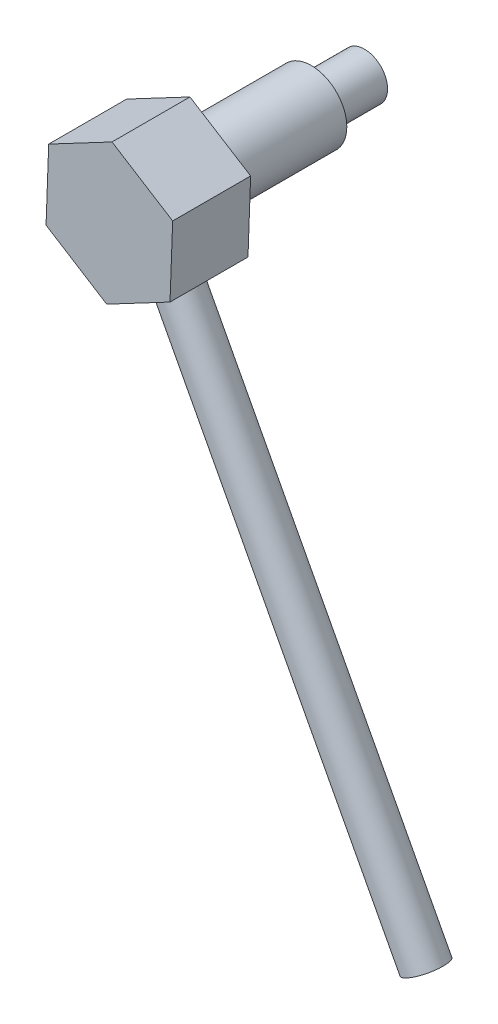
ISO-10303-21;
HEADER;
FILE_DESCRIPTION(('STEP AP214'),'2;1');
FILE_NAME('part.step','',(''),(''),'','','');
FILE_SCHEMA(('AUTOMOTIVE_DESIGN { 1 0 10303 214 1 1 1 1 }'));
ENDSEC;
DATA;
#1=APPLICATION_CONTEXT('core data for automotive mechanical design processes');
#2=APPLICATION_PROTOCOL_DEFINITION('international standard','automotive_design',2000,#1);
#3=PRODUCT_CONTEXT('',#1,'mechanical');
#4=PRODUCT('Part','Part','',(#3));
#5=PRODUCT_RELATED_PRODUCT_CATEGORY('part','',(#4));
#6=PRODUCT_DEFINITION_FORMATION('','',#4);
#7=PRODUCT_DEFINITION_CONTEXT('part definition',#1,'design');
#8=PRODUCT_DEFINITION('design','',#6,#7);
#9=PRODUCT_DEFINITION_SHAPE('','',#8);
#10=(LENGTH_UNIT() NAMED_UNIT(*) SI_UNIT(.MILLI.,.METRE.));
#11=(NAMED_UNIT(*) PLANE_ANGLE_UNIT() SI_UNIT($,.RADIAN.));
#12=(NAMED_UNIT(*) SI_UNIT($,.STERADIAN.) SOLID_ANGLE_UNIT());
#13=UNCERTAINTY_MEASURE_WITH_UNIT(LENGTH_MEASURE(1.E-05),#10,'distance_accuracy_value','');
#14=(GEOMETRIC_REPRESENTATION_CONTEXT(3) GLOBAL_UNCERTAINTY_ASSIGNED_CONTEXT((#13)) GLOBAL_UNIT_ASSIGNED_CONTEXT((#10,
#11,#12)) REPRESENTATION_CONTEXT('',''));
#15=CARTESIAN_POINT('',(0.,0.,0.));
#16=DIRECTION('',(0.,0.,1.));
#17=DIRECTION('',(1.,0.,0.));
#18=AXIS2_PLACEMENT_3D('',#15,#16,#17);
#19=CARTESIAN_POINT('',(-0.149575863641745,-4.03868300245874,4.4));
#20=DIRECTION('',(-0.467605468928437,0.883937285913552,0.));
#21=DIRECTION('',(-0.883937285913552,-0.467605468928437,0.));
#22=AXIS2_PLACEMENT_3D('',#19,#20,#21);
#23=PLANE('',#22);
#24=DIRECTION('',(0.883937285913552,0.467605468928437,0.));
#25=VECTOR('',#24,1.);
#26=CARTESIAN_POINT('',(-0.149575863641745,-4.03868300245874,0.));
#27=LINE('',#26,#25);
#28=CARTESIAN_POINT('',(-0.149575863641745,-4.03868300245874,0.));
#29=VERTEX_POINT('',#28);
#30=CARTESIAN_POINT('',(3.42281414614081,-2.14887799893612,0.));
#31=VERTEX_POINT('',#30);
#32=EDGE_CURVE('E56',#29,#31,#27,.T.);
#33=ORIENTED_EDGE('',*,*,#32,.T.);
#34=DIRECTION('',(0.,0.,-1.));
#35=VECTOR('',#34,1.);
#36=CARTESIAN_POINT('',(3.42281414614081,-2.14887799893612,4.4));
#37=LINE('',#36,#35);
#38=CARTESIAN_POINT('',(3.42281414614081,-2.14887799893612,4.4));
#39=VERTEX_POINT('',#38);
#40=EDGE_CURVE('E94',#39,#31,#37,.T.);
#41=ORIENTED_EDGE('',*,*,#40,.F.);
#42=DIRECTION('',(0.883937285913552,0.467605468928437,0.));
#43=VECTOR('',#42,1.);
#44=CARTESIAN_POINT('',(-0.149575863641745,-4.03868300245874,4.4));
#45=LINE('',#44,#43);
#46=CARTESIAN_POINT('',(-0.149575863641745,-4.03868300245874,4.4));
#47=VERTEX_POINT('',#46);
#48=EDGE_CURVE('E82',#47,#39,#45,.T.);
#49=ORIENTED_EDGE('',*,*,#48,.F.);
#50=DIRECTION('',(0.,0.,-1.));
#51=VECTOR('',#50,1.);
#52=CARTESIAN_POINT('',(-0.149575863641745,-4.03868300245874,4.4));
#53=LINE('',#52,#51);
#54=EDGE_CURVE('E89',#47,#29,#53,.T.);
#55=ORIENTED_EDGE('',*,*,#54,.T.);
#56=EDGE_LOOP('',(#33,#41,#49,#55));
#57=FACE_BOUND('',#56,.T.);
#58=CARTESIAN_POINT('',(1.63661914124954,-3.09378050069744,2.2));
#59=DIRECTION('',(-0.467605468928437,0.883937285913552,0.));
#60=DIRECTION('',(-0.883937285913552,-0.467605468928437,0.));
#61=AXIS2_PLACEMENT_3D('',#58,#59,#60);
#62=CIRCLE('',#61,1.1);
#63=CARTESIAN_POINT('',(0.664288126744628,-3.60814651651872,2.2));
#64=VERTEX_POINT('',#63);
#65=EDGE_CURVE('E11',#64,#64,#62,.F.);
#66=ORIENTED_EDGE('',*,*,#65,.F.);
#67=EDGE_LOOP('',(#66));
#68=FACE_BOUND('',#67,.T.);
#69=ADVANCED_FACE('F16',(#57,#68),#23,.F.);
#70=CARTESIAN_POINT('',(0.,0.,-7.));
#71=DIRECTION('',(0.,0.,-1.));
#72=DIRECTION('',(-1.,0.,0.));
#73=AXIS2_PLACEMENT_3D('',#70,#71,#72);
#74=PLANE('',#73);
#75=CARTESIAN_POINT('',(0.,0.,-7.));
#76=DIRECTION('',(0.,0.,-1.));
#77=DIRECTION('',(-1.,0.,0.));
#78=AXIS2_PLACEMENT_3D('',#75,#76,#77);
#79=CIRCLE('',#78,2.);
#80=CARTESIAN_POINT('',(-2.,0.,-7.));
#81=VERTEX_POINT('',#80);
#82=EDGE_CURVE('E106',#81,#81,#79,.T.);
#83=ORIENTED_EDGE('',*,*,#82,.T.);
#84=EDGE_LOOP('',(#83));
#85=FACE_BOUND('',#84,.T.);
#86=CARTESIAN_POINT('',(0.,0.,-7.));
#87=DIRECTION('',(0.,0.,-1.));
#88=DIRECTION('',(-1.,0.,0.));
#89=AXIS2_PLACEMENT_3D('',#86,#87,#88);
#90=CIRCLE('',#89,1.3);
#91=CARTESIAN_POINT('',(-1.3,0.,-7.));
#92=VERTEX_POINT('',#91);
#93=EDGE_CURVE('E197',#92,#92,#90,.T.);
#94=ORIENTED_EDGE('',*,*,#93,.F.);
#95=EDGE_LOOP('',(#94));
#96=FACE_BOUND('',#95,.T.);
#97=ADVANCED_FACE('F128',(#85,#96),#74,.T.);
#98=CARTESIAN_POINT('',(0.,0.,0.));
#99=DIRECTION('',(0.,0.,1.));
#100=DIRECTION('',(1.,0.,0.));
#101=AXIS2_PLACEMENT_3D('',#98,#99,#100);
#102=PLANE('',#101);
#103=DIRECTION('',(-0.846926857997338,0.531709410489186,0.));
#104=VECTOR('',#103,1.);
#105=CARTESIAN_POINT('',(3.57239000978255,1.88980500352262,0.));
#106=LINE('',#105,#104);
#107=CARTESIAN_POINT('',(3.57239000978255,1.88980500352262,0.));
#108=VERTEX_POINT('',#107);
#109=CARTESIAN_POINT('',(0.149575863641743,4.03868300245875,0.));
#110=VERTEX_POINT('',#109);
#111=EDGE_CURVE('E102',#108,#110,#106,.T.);
#112=ORIENTED_EDGE('',*,*,#111,.F.);
#113=DIRECTION('',(0.037010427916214,0.999314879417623,0.));
#114=VECTOR('',#113,1.);
#115=CARTESIAN_POINT('',(3.42281414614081,-2.14887799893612,0.));
#116=LINE('',#115,#114);
#117=EDGE_CURVE('E62',#31,#108,#116,.T.);
#118=ORIENTED_EDGE('',*,*,#117,.F.);
#119=ORIENTED_EDGE('',*,*,#32,.F.);
#120=DIRECTION('',(0.846926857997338,-0.531709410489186,0.));
#121=VECTOR('',#120,1.);
#122=CARTESIAN_POINT('',(-3.57239000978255,-1.88980500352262,0.));
#123=LINE('',#122,#121);
#124=CARTESIAN_POINT('',(-3.57239000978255,-1.88980500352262,0.));
#125=VERTEX_POINT('',#124);
#126=EDGE_CURVE('E92',#125,#29,#123,.T.);
#127=ORIENTED_EDGE('',*,*,#126,.F.);
#128=DIRECTION('',(-0.0370104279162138,-0.999314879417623,0.));
#129=VECTOR('',#128,1.);
#130=CARTESIAN_POINT('',(-3.42281414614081,2.14887799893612,0.));
#131=LINE('',#130,#129);
#132=CARTESIAN_POINT('',(-3.42281414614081,2.14887799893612,0.));
#133=VERTEX_POINT('',#132);
#134=EDGE_CURVE('E108',#133,#125,#131,.T.);
#135=ORIENTED_EDGE('',*,*,#134,.F.);
#136=DIRECTION('',(-0.883937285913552,-0.467605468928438,0.));
#137=VECTOR('',#136,1.);
#138=CARTESIAN_POINT('',(0.149575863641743,4.03868300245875,0.));
#139=LINE('',#138,#137);
#140=EDGE_CURVE('E105',#110,#133,#139,.T.);
#141=ORIENTED_EDGE('',*,*,#140,.F.);
#142=EDGE_LOOP('',(#112,#118,#119,#127,#135,#141));
#143=FACE_BOUND('',#142,.T.);
#144=CARTESIAN_POINT('',(0.,0.,0.));
#145=DIRECTION('',(0.,0.,1.));
#146=DIRECTION('',(1.,0.,0.));
#147=AXIS2_PLACEMENT_3D('',#144,#145,#146);
#148=CIRCLE('',#147,2.);
#149=CARTESIAN_POINT('',(2.,0.,0.));
#150=VERTEX_POINT('',#149);
#151=EDGE_CURVE('E25',#150,#150,#148,.F.);
#152=ORIENTED_EDGE('',*,*,#151,.F.);
#153=EDGE_LOOP('',(#152));
#154=FACE_BOUND('',#153,.T.);
#155=ADVANCED_FACE('F126',(#143,#154),#102,.F.);
#156=CARTESIAN_POINT('',(3.57239000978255,1.88980500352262,4.4));
#157=DIRECTION('',(-0.531709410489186,-0.846926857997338,0.));
#158=DIRECTION('',(0.846926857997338,-0.531709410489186,0.));
#159=AXIS2_PLACEMENT_3D('',#156,#157,#158);
#160=PLANE('',#159);
#161=ORIENTED_EDGE('',*,*,#111,.T.);
#162=DIRECTION('',(0.,0.,-1.));
#163=VECTOR('',#162,1.);
#164=CARTESIAN_POINT('',(0.149575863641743,4.03868300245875,4.4));
#165=LINE('',#164,#163);
#166=CARTESIAN_POINT('',(0.149575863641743,4.03868300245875,4.4));
#167=VERTEX_POINT('',#166);
#168=EDGE_CURVE('E120',#167,#110,#165,.T.);
#169=ORIENTED_EDGE('',*,*,#168,.F.);
#170=DIRECTION('',(-0.846926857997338,0.531709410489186,0.));
#171=VECTOR('',#170,1.);
#172=CARTESIAN_POINT('',(3.57239000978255,1.88980500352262,4.4));
#173=LINE('',#172,#171);
#174=CARTESIAN_POINT('',(3.57239000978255,1.88980500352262,4.4));
#175=VERTEX_POINT('',#174);
#176=EDGE_CURVE('E113',#175,#167,#173,.T.);
#177=ORIENTED_EDGE('',*,*,#176,.F.);
#178=DIRECTION('',(0.,0.,-1.));
#179=VECTOR('',#178,1.);
#180=CARTESIAN_POINT('',(3.57239000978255,1.88980500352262,4.4));
#181=LINE('',#180,#179);
#182=EDGE_CURVE('E98',#175,#108,#181,.T.);
#183=ORIENTED_EDGE('',*,*,#182,.T.);
#184=EDGE_LOOP('',(#161,#169,#177,#183));
#185=FACE_BOUND('',#184,.T.);
#186=ADVANCED_FACE('F18',(#185),#160,.F.);
#187=CARTESIAN_POINT('',(0.149575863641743,4.03868300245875,4.4));
#188=DIRECTION('',(0.467605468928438,-0.883937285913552,0.));
#189=DIRECTION('',(0.883937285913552,0.467605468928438,0.));
#190=AXIS2_PLACEMENT_3D('',#187,#188,#189);
#191=PLANE('',#190);
#192=ORIENTED_EDGE('',*,*,#140,.T.);
#193=DIRECTION('',(0.,0.,-1.));
#194=VECTOR('',#193,1.);
#195=CARTESIAN_POINT('',(-3.42281414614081,2.14887799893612,4.4));
#196=LINE('',#195,#194);
#197=CARTESIAN_POINT('',(-3.42281414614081,2.14887799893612,4.4));
#198=VERTEX_POINT('',#197);
#199=EDGE_CURVE('E117',#198,#133,#196,.T.);
#200=ORIENTED_EDGE('',*,*,#199,.F.);
#201=DIRECTION('',(-0.883937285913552,-0.467605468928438,0.));
#202=VECTOR('',#201,1.);
#203=CARTESIAN_POINT('',(0.149575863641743,4.03868300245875,4.4));
#204=LINE('',#203,#202);
#205=EDGE_CURVE('E71',#167,#198,#204,.T.);
#206=ORIENTED_EDGE('',*,*,#205,.F.);
#207=ORIENTED_EDGE('',*,*,#168,.T.);
#208=EDGE_LOOP('',(#192,#200,#206,#207));
#209=FACE_BOUND('',#208,.T.);
#210=ADVANCED_FACE('F137',(#209),#191,.F.);
#211=CARTESIAN_POINT('',(-3.42281414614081,2.14887799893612,4.4));
#212=DIRECTION('',(0.999314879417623,-0.0370104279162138,0.));
#213=DIRECTION('',(0.0370104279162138,0.999314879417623,0.));
#214=AXIS2_PLACEMENT_3D('',#211,#212,#213);
#215=PLANE('',#214);
#216=ORIENTED_EDGE('',*,*,#134,.T.);
#217=DIRECTION('',(0.,0.,-1.));
#218=VECTOR('',#217,1.);
#219=CARTESIAN_POINT('',(-3.57239000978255,-1.88980500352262,4.4));
#220=LINE('',#219,#218);
#221=CARTESIAN_POINT('',(-3.57239000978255,-1.88980500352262,4.4));
#222=VERTEX_POINT('',#221);
#223=EDGE_CURVE('E93',#222,#125,#220,.T.);
#224=ORIENTED_EDGE('',*,*,#223,.F.);
#225=DIRECTION('',(-0.0370104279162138,-0.999314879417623,0.));
#226=VECTOR('',#225,1.);
#227=CARTESIAN_POINT('',(-3.42281414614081,2.14887799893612,4.4));
#228=LINE('',#227,#226);
#229=EDGE_CURVE('E84',#198,#222,#228,.T.);
#230=ORIENTED_EDGE('',*,*,#229,.F.);
#231=ORIENTED_EDGE('',*,*,#199,.T.);
#232=EDGE_LOOP('',(#216,#224,#230,#231));
#233=FACE_BOUND('',#232,.T.);
#234=ADVANCED_FACE('F153',(#233),#215,.F.);
#235=CARTESIAN_POINT('',(-3.57239000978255,-1.88980500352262,4.4));
#236=DIRECTION('',(0.531709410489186,0.846926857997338,0.));
#237=DIRECTION('',(-0.846926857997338,0.531709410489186,0.));
#238=AXIS2_PLACEMENT_3D('',#235,#236,#237);
#239=PLANE('',#238);
#240=ORIENTED_EDGE('',*,*,#126,.T.);
#241=ORIENTED_EDGE('',*,*,#54,.F.);
#242=DIRECTION('',(0.846926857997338,-0.531709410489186,0.));
#243=VECTOR('',#242,1.);
#244=CARTESIAN_POINT('',(-3.57239000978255,-1.88980500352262,4.4));
#245=LINE('',#244,#243);
#246=EDGE_CURVE('E78',#222,#47,#245,.T.);
#247=ORIENTED_EDGE('',*,*,#246,.F.);
#248=ORIENTED_EDGE('',*,*,#223,.T.);
#249=EDGE_LOOP('',(#240,#241,#247,#248));
#250=FACE_BOUND('',#249,.T.);
#251=ADVANCED_FACE('F90',(#250),#239,.F.);
#252=CARTESIAN_POINT('',(3.42281414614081,-2.14887799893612,4.4));
#253=DIRECTION('',(-0.999314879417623,0.037010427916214,0.));
#254=DIRECTION('',(-0.037010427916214,-0.999314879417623,0.));
#255=AXIS2_PLACEMENT_3D('',#252,#253,#254);
#256=PLANE('',#255);
#257=ORIENTED_EDGE('',*,*,#117,.T.);
#258=ORIENTED_EDGE('',*,*,#182,.F.);
#259=DIRECTION('',(0.037010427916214,0.999314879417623,0.));
#260=VECTOR('',#259,1.);
#261=CARTESIAN_POINT('',(3.42281414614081,-2.14887799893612,4.4));
#262=LINE('',#261,#260);
#263=EDGE_CURVE('E33',#39,#175,#262,.T.);
#264=ORIENTED_EDGE('',*,*,#263,.F.);
#265=ORIENTED_EDGE('',*,*,#40,.T.);
#266=EDGE_LOOP('',(#257,#258,#264,#265));
#267=FACE_BOUND('',#266,.T.);
#268=ADVANCED_FACE('F150',(#267),#256,.F.);
#269=CARTESIAN_POINT('',(0.,0.,4.4));
#270=DIRECTION('',(0.,0.,1.));
#271=DIRECTION('',(1.,0.,0.));
#272=AXIS2_PLACEMENT_3D('',#269,#270,#271);
#273=PLANE('',#272);
#274=ORIENTED_EDGE('',*,*,#176,.T.);
#275=ORIENTED_EDGE('',*,*,#205,.T.);
#276=ORIENTED_EDGE('',*,*,#229,.T.);
#277=ORIENTED_EDGE('',*,*,#246,.T.);
#278=ORIENTED_EDGE('',*,*,#48,.T.);
#279=ORIENTED_EDGE('',*,*,#263,.T.);
#280=EDGE_LOOP('',(#274,#275,#276,#277,#278,#279));
#281=FACE_BOUND('',#280,.T.);
#282=ADVANCED_FACE('F80',(#281),#273,.T.);
#283=CARTESIAN_POINT('',(0.,0.,-7.));
#284=DIRECTION('',(0.,0.,1.));
#285=DIRECTION('',(1.,0.,0.));
#286=AXIS2_PLACEMENT_3D('',#283,#284,#285);
#287=CYLINDRICAL_SURFACE('',#286,2.);
#288=ORIENTED_EDGE('',*,*,#82,.F.);
#289=EDGE_LOOP('',(#288));
#290=FACE_BOUND('',#289,.T.);
#291=ORIENTED_EDGE('',*,*,#151,.T.);
#292=EDGE_LOOP('',(#291));
#293=FACE_BOUND('',#292,.T.);
#294=ADVANCED_FACE('F124',(#290,#293),#287,.T.);
#295=CARTESIAN_POINT('',(0.,0.,-10.));
#296=DIRECTION('',(0.,0.,1.));
#297=DIRECTION('',(1.,0.,0.));
#298=AXIS2_PLACEMENT_3D('',#295,#296,#297);
#299=CYLINDRICAL_SURFACE('',#298,1.3);
#300=CARTESIAN_POINT('',(0.,0.,-10.));
#301=DIRECTION('',(0.,0.,-1.));
#302=DIRECTION('',(-1.,0.,0.));
#303=AXIS2_PLACEMENT_3D('',#300,#301,#302);
#304=CIRCLE('',#303,1.3);
#305=CARTESIAN_POINT('',(-1.3,0.,-10.));
#306=VERTEX_POINT('',#305);
#307=EDGE_CURVE('E200',#306,#306,#304,.T.);
#308=ORIENTED_EDGE('',*,*,#307,.F.);
#309=EDGE_LOOP('',(#308));
#310=FACE_BOUND('',#309,.T.);
#311=ORIENTED_EDGE('',*,*,#93,.T.);
#312=EDGE_LOOP('',(#311));
#313=FACE_BOUND('',#312,.T.);
#314=ADVANCED_FACE('F173',(#310,#313),#299,.T.);
#315=CARTESIAN_POINT('',(0.,0.,-10.));
#316=DIRECTION('',(0.,0.,-1.));
#317=DIRECTION('',(-1.,0.,0.));
#318=AXIS2_PLACEMENT_3D('',#315,#316,#317);
#319=PLANE('',#318);
#320=ORIENTED_EDGE('',*,*,#307,.T.);
#321=EDGE_LOOP('',(#320));
#322=FACE_BOUND('',#321,.T.);
#323=ADVANCED_FACE('F179',(#322),#319,.T.);
#324=CARTESIAN_POINT('',(15.6647832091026,-29.611899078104,2.2));
#325=DIRECTION('',(-0.467605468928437,0.883937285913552,0.));
#326=DIRECTION('',(-0.883937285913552,-0.467605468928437,0.));
#327=AXIS2_PLACEMENT_3D('',#324,#325,#326);
#328=CYLINDRICAL_SURFACE('',#327,1.1);
#329=CARTESIAN_POINT('',(15.6647832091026,-29.611899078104,2.2));
#330=DIRECTION('',(0.467605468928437,-0.883937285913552,0.));
#331=DIRECTION('',(0.883937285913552,0.467605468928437,0.));
#332=AXIS2_PLACEMENT_3D('',#329,#330,#331);
#333=CIRCLE('',#332,1.1);
#334=CARTESIAN_POINT('',(16.6371142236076,-29.0975330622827,2.2));
#335=VERTEX_POINT('',#334);
#336=EDGE_CURVE('E196',#335,#335,#333,.T.);
#337=ORIENTED_EDGE('',*,*,#336,.F.);
#338=EDGE_LOOP('',(#337));
#339=FACE_BOUND('',#338,.T.);
#340=ORIENTED_EDGE('',*,*,#65,.T.);
#341=EDGE_LOOP('',(#340));
#342=FACE_BOUND('',#341,.T.);
#343=ADVANCED_FACE('F183',(#339,#342),#328,.T.);
#344=CARTESIAN_POINT('',(15.6647832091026,-29.611899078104,2.2));
#345=DIRECTION('',(0.467605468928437,-0.883937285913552,0.));
#346=DIRECTION('',(0.883937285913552,0.467605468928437,0.));
#347=AXIS2_PLACEMENT_3D('',#344,#345,#346);
#348=PLANE('',#347);
#349=ORIENTED_EDGE('',*,*,#336,.T.);
#350=EDGE_LOOP('',(#349));
#351=FACE_BOUND('',#350,.T.);
#352=ADVANCED_FACE('F187',(#351),#348,.T.);
#353=CLOSED_SHELL('',(#69,#97,#155,#186,#210,#234,#251,#268,#282,#294,#314,#323,#343,#352));
#354=MANIFOLD_SOLID_BREP('B1',#353);
#355=ADVANCED_BREP_SHAPE_REPRESENTATION('',(#18,#354),#14);
#356=SHAPE_DEFINITION_REPRESENTATION(#9,#355);
ENDSEC;
END-ISO-10303-21;
